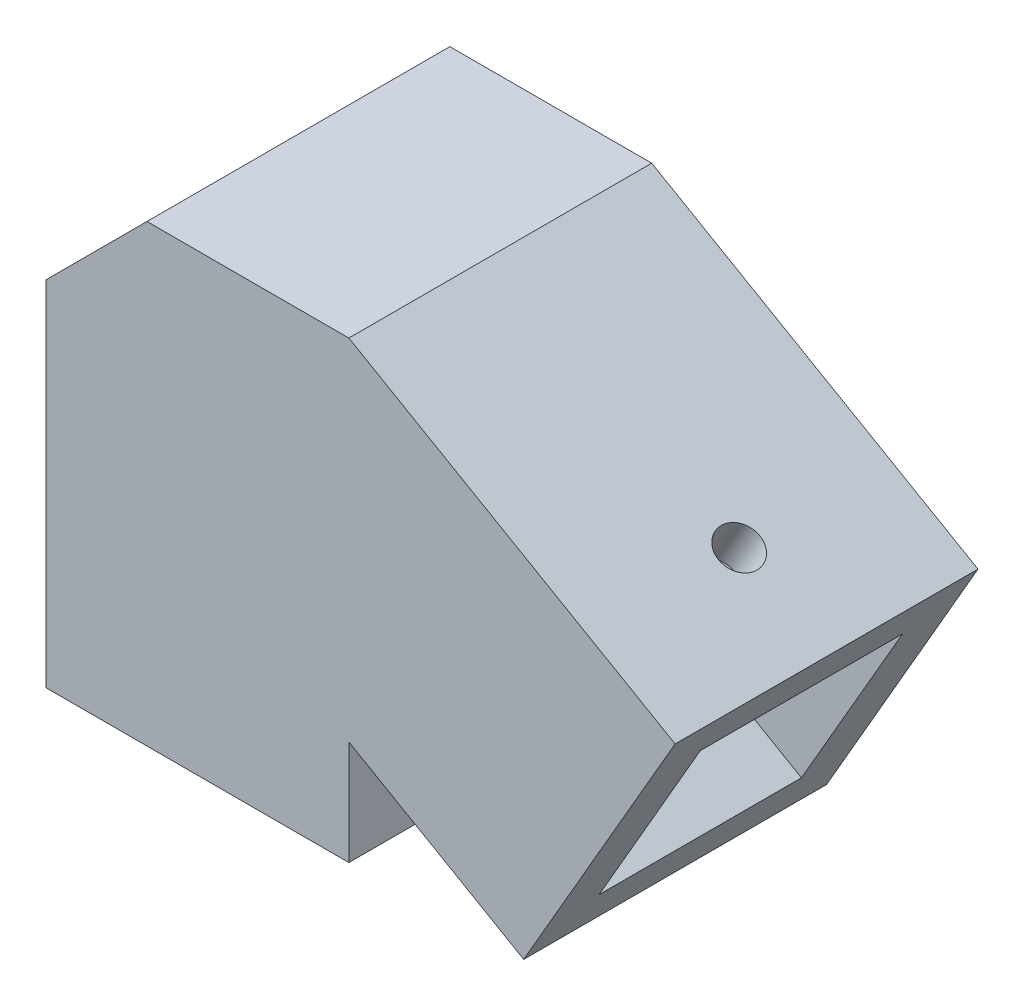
ISO-10303-21;
HEADER;
FILE_DESCRIPTION(('STEP AP214'),'2;1');
FILE_NAME('part.step','',(''),(''),'','','');
FILE_SCHEMA(('AUTOMOTIVE_DESIGN { 1 0 10303 214 1 1 1 1 }'));
ENDSEC;
DATA;
#1=APPLICATION_CONTEXT('core data for automotive mechanical design processes');
#2=APPLICATION_PROTOCOL_DEFINITION('international standard','automotive_design',2000,#1);
#3=PRODUCT_CONTEXT('',#1,'mechanical');
#4=PRODUCT('Part','Part','',(#3));
#5=PRODUCT_RELATED_PRODUCT_CATEGORY('part','',(#4));
#6=PRODUCT_DEFINITION_FORMATION('','',#4);
#7=PRODUCT_DEFINITION_CONTEXT('part definition',#1,'design');
#8=PRODUCT_DEFINITION('design','',#6,#7);
#9=PRODUCT_DEFINITION_SHAPE('','',#8);
#10=(LENGTH_UNIT() NAMED_UNIT(*) SI_UNIT(.MILLI.,.METRE.));
#11=(NAMED_UNIT(*) PLANE_ANGLE_UNIT() SI_UNIT($,.RADIAN.));
#12=(NAMED_UNIT(*) SI_UNIT($,.STERADIAN.) SOLID_ANGLE_UNIT());
#13=UNCERTAINTY_MEASURE_WITH_UNIT(LENGTH_MEASURE(1.E-05),#10,'distance_accuracy_value','');
#14=(GEOMETRIC_REPRESENTATION_CONTEXT(3) GLOBAL_UNCERTAINTY_ASSIGNED_CONTEXT((#13)) GLOBAL_UNIT_ASSIGNED_CONTEXT((#10,
#11,#12)) REPRESENTATION_CONTEXT('',''));
#15=CARTESIAN_POINT('',(0.,0.,0.));
#16=DIRECTION('',(0.,0.,1.));
#17=DIRECTION('',(1.,0.,0.));
#18=AXIS2_PLACEMENT_3D('',#15,#16,#17);
#19=CARTESIAN_POINT('',(15.,-25.,15.));
#20=DIRECTION('',(1.,0.,0.));
#21=DIRECTION('',(0.,0.,-1.));
#22=AXIS2_PLACEMENT_3D('',#19,#20,#21);
#23=PLANE('',#22);
#24=DIRECTION('',(0.,1.,0.));
#25=VECTOR('',#24,1.);
#26=CARTESIAN_POINT('',(15.,-25.,-15.));
#27=LINE('',#26,#25);
#28=CARTESIAN_POINT('',(15.,-25.,-15.));
#29=VERTEX_POINT('',#28);
#30=CARTESIAN_POINT('',(15.,-14.6410161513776,-15.));
#31=VERTEX_POINT('',#30);
#32=EDGE_CURVE('E324',#29,#31,#27,.T.);
#33=ORIENTED_EDGE('',*,*,#32,.T.);
#34=DIRECTION('',(0.,0.,1.));
#35=VECTOR('',#34,1.);
#36=CARTESIAN_POINT('',(15.,-14.6410161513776,-70.1129346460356));
#37=LINE('',#36,#35);
#38=CARTESIAN_POINT('',(15.,-14.6410161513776,15.));
#39=VERTEX_POINT('',#38);
#40=EDGE_CURVE('E282',#31,#39,#37,.T.);
#41=ORIENTED_EDGE('',*,*,#40,.T.);
#42=DIRECTION('',(0.,1.,0.));
#43=VECTOR('',#42,1.);
#44=CARTESIAN_POINT('',(15.,-25.,15.));
#45=LINE('',#44,#43);
#46=CARTESIAN_POINT('',(15.,-25.,15.));
#47=VERTEX_POINT('',#46);
#48=EDGE_CURVE('E321',#47,#39,#45,.T.);
#49=ORIENTED_EDGE('',*,*,#48,.F.);
#50=DIRECTION('',(0.,0.,-1.));
#51=VECTOR('',#50,1.);
#52=CARTESIAN_POINT('',(15.,-25.,15.));
#53=LINE('',#52,#51);
#54=EDGE_CURVE('E304',#47,#29,#53,.T.);
#55=ORIENTED_EDGE('',*,*,#54,.T.);
#56=EDGE_LOOP('',(#33,#41,#49,#55));
#57=FACE_BOUND('',#56,.T.);
#58=ADVANCED_FACE('F50',(#57),#23,.T.);
#59=CARTESIAN_POINT('',(-15.,-25.,15.));
#60=DIRECTION('',(0.,0.,1.));
#61=DIRECTION('',(1.,0.,0.));
#62=AXIS2_PLACEMENT_3D('',#59,#60,#61);
#63=PLANE('',#62);
#64=DIRECTION('',(1.,0.,0.));
#65=VECTOR('',#64,1.);
#66=CARTESIAN_POINT('',(-15.,20.,15.));
#67=LINE('',#66,#65);
#68=CARTESIAN_POINT('',(-5.00000000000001,20.,15.));
#69=VERTEX_POINT('',#68);
#70=CARTESIAN_POINT('',(15.,20.,15.));
#71=VERTEX_POINT('',#70);
#72=EDGE_CURVE('E305',#69,#71,#67,.T.);
#73=ORIENTED_EDGE('',*,*,#72,.F.);
#74=DIRECTION('',(-0.707106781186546,-0.707106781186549,0.));
#75=VECTOR('',#74,1.);
#76=CARTESIAN_POINT('',(-32.5,-7.50000000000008,15.));
#77=LINE('',#76,#75);
#78=CARTESIAN_POINT('',(-15.,9.99999999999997,15.));
#79=VERTEX_POINT('',#78);
#80=EDGE_CURVE('E71',#69,#79,#77,.T.);
#81=ORIENTED_EDGE('',*,*,#80,.T.);
#82=DIRECTION('',(0.,1.,0.));
#83=VECTOR('',#82,1.);
#84=CARTESIAN_POINT('',(-15.,-25.,15.));
#85=LINE('',#84,#83);
#86=CARTESIAN_POINT('',(-15.,-25.,15.));
#87=VERTEX_POINT('',#86);
#88=EDGE_CURVE('E330',#87,#79,#85,.T.);
#89=ORIENTED_EDGE('',*,*,#88,.F.);
#90=DIRECTION('',(1.,0.,0.));
#91=VECTOR('',#90,1.);
#92=CARTESIAN_POINT('',(-15.,-25.,15.));
#93=LINE('',#92,#91);
#94=EDGE_CURVE('E320',#87,#47,#93,.T.);
#95=ORIENTED_EDGE('',*,*,#94,.T.);
#96=ORIENTED_EDGE('',*,*,#48,.T.);
#97=DIRECTION('',(0.866025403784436,-0.500000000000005,0.));
#98=VECTOR('',#97,1.);
#99=CARTESIAN_POINT('',(15.,-14.6410161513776,15.));
#100=LINE('',#99,#98);
#101=CARTESIAN_POINT('',(32.3205080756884,-24.6410161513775,15.));
#102=VERTEX_POINT('',#101);
#103=EDGE_CURVE('E255',#39,#102,#100,.T.);
#104=ORIENTED_EDGE('',*,*,#103,.T.);
#105=DIRECTION('',(0.500000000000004,0.866025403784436,0.));
#106=VECTOR('',#105,1.);
#107=CARTESIAN_POINT('',(32.3205080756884,-24.6410161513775,15.));
#108=LINE('',#107,#106);
#109=CARTESIAN_POINT('',(47.3205080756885,1.33974596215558,15.));
#110=VERTEX_POINT('',#109);
#111=EDGE_CURVE('E267',#102,#110,#108,.T.);
#112=ORIENTED_EDGE('',*,*,#111,.T.);
#113=DIRECTION('',(-0.866025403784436,0.500000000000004,0.));
#114=VECTOR('',#113,1.);
#115=CARTESIAN_POINT('',(15.,20.,15.));
#116=LINE('',#115,#114);
#117=EDGE_CURVE('E265',#110,#71,#116,.T.);
#118=ORIENTED_EDGE('',*,*,#117,.T.);
#119=EDGE_LOOP('',(#73,#81,#89,#95,#96,#104,#112,#118));
#120=FACE_BOUND('',#119,.T.);
#121=ADVANCED_FACE('F348',(#120),#63,.T.);
#122=CARTESIAN_POINT('',(-15.,-25.,15.));
#123=DIRECTION('',(-1.,0.,0.));
#124=DIRECTION('',(0.,0.,1.));
#125=AXIS2_PLACEMENT_3D('',#122,#123,#124);
#126=PLANE('',#125);
#127=CARTESIAN_POINT('',(-15.,-15.,0.));
#128=DIRECTION('',(-1.,0.,0.));
#129=DIRECTION('',(0.,0.,1.));
#130=AXIS2_PLACEMENT_3D('',#127,#128,#129);
#131=CIRCLE('',#130,2.05);
#132=CARTESIAN_POINT('',(-15.,-15.,2.05));
#133=VERTEX_POINT('',#132);
#134=EDGE_CURVE('E437',#133,#133,#131,.T.);
#135=ORIENTED_EDGE('',*,*,#134,.F.);
#136=EDGE_LOOP('',(#135));
#137=FACE_BOUND('',#136,.T.);
#138=ORIENTED_EDGE('',*,*,#88,.T.);
#139=DIRECTION('',(0.,0.,-1.));
#140=VECTOR('',#139,1.);
#141=CARTESIAN_POINT('',(-15.,9.99999999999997,-15.));
#142=LINE('',#141,#140);
#143=CARTESIAN_POINT('',(-15.,9.99999999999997,-15.));
#144=VERTEX_POINT('',#143);
#145=EDGE_CURVE('E60',#79,#144,#142,.T.);
#146=ORIENTED_EDGE('',*,*,#145,.T.);
#147=DIRECTION('',(0.,1.,0.));
#148=VECTOR('',#147,1.);
#149=CARTESIAN_POINT('',(-15.,-25.,-15.));
#150=LINE('',#149,#148);
#151=CARTESIAN_POINT('',(-15.,-25.,-15.));
#152=VERTEX_POINT('',#151);
#153=EDGE_CURVE('E326',#152,#144,#150,.T.);
#154=ORIENTED_EDGE('',*,*,#153,.F.);
#155=DIRECTION('',(0.,0.,1.));
#156=VECTOR('',#155,1.);
#157=CARTESIAN_POINT('',(-15.,-25.,15.));
#158=LINE('',#157,#156);
#159=EDGE_CURVE('E312',#152,#87,#158,.T.);
#160=ORIENTED_EDGE('',*,*,#159,.T.);
#161=EDGE_LOOP('',(#138,#146,#154,#160));
#162=FACE_BOUND('',#161,.T.);
#163=ADVANCED_FACE('F372',(#137,#162),#126,.T.);
#164=CARTESIAN_POINT('',(-15.,-25.,-15.));
#165=DIRECTION('',(0.,0.,-1.));
#166=DIRECTION('',(-1.,0.,0.));
#167=AXIS2_PLACEMENT_3D('',#164,#165,#166);
#168=PLANE('',#167);
#169=ORIENTED_EDGE('',*,*,#153,.T.);
#170=DIRECTION('',(0.707106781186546,0.707106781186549,0.));
#171=VECTOR('',#170,1.);
#172=CARTESIAN_POINT('',(-32.5,-7.50000000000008,-15.));
#173=LINE('',#172,#171);
#174=CARTESIAN_POINT('',(-5.00000000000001,20.,-15.));
#175=VERTEX_POINT('',#174);
#176=EDGE_CURVE('E11',#144,#175,#173,.T.);
#177=ORIENTED_EDGE('',*,*,#176,.T.);
#178=DIRECTION('',(-1.,0.,0.));
#179=VECTOR('',#178,1.);
#180=CARTESIAN_POINT('',(-15.,20.,-15.));
#181=LINE('',#180,#179);
#182=CARTESIAN_POINT('',(15.,20.,-15.));
#183=VERTEX_POINT('',#182);
#184=EDGE_CURVE('E296',#183,#175,#181,.T.);
#185=ORIENTED_EDGE('',*,*,#184,.F.);
#186=DIRECTION('',(-0.866025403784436,0.500000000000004,0.));
#187=VECTOR('',#186,1.);
#188=CARTESIAN_POINT('',(15.,20.,-15.));
#189=LINE('',#188,#187);
#190=CARTESIAN_POINT('',(47.3205080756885,1.33974596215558,-15.));
#191=VERTEX_POINT('',#190);
#192=EDGE_CURVE('E280',#191,#183,#189,.T.);
#193=ORIENTED_EDGE('',*,*,#192,.F.);
#194=DIRECTION('',(0.500000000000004,0.866025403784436,0.));
#195=VECTOR('',#194,1.);
#196=CARTESIAN_POINT('',(32.3205080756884,-24.6410161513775,-15.));
#197=LINE('',#196,#195);
#198=CARTESIAN_POINT('',(32.3205080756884,-24.6410161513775,-15.));
#199=VERTEX_POINT('',#198);
#200=EDGE_CURVE('E283',#199,#191,#197,.T.);
#201=ORIENTED_EDGE('',*,*,#200,.F.);
#202=DIRECTION('',(0.866025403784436,-0.500000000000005,0.));
#203=VECTOR('',#202,1.);
#204=CARTESIAN_POINT('',(15.,-14.6410161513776,-15.));
#205=LINE('',#204,#203);
#206=EDGE_CURVE('E266',#31,#199,#205,.T.);
#207=ORIENTED_EDGE('',*,*,#206,.F.);
#208=ORIENTED_EDGE('',*,*,#32,.F.);
#209=DIRECTION('',(-1.,0.,0.));
#210=VECTOR('',#209,1.);
#211=CARTESIAN_POINT('',(-15.,-25.,-15.));
#212=LINE('',#211,#210);
#213=EDGE_CURVE('E307',#29,#152,#212,.T.);
#214=ORIENTED_EDGE('',*,*,#213,.T.);
#215=EDGE_LOOP('',(#169,#177,#185,#193,#201,#207,#208,#214));
#216=FACE_BOUND('',#215,.T.);
#217=ADVANCED_FACE('F355',(#216),#168,.T.);
#218=CARTESIAN_POINT('',(0.,-25.,0.));
#219=DIRECTION('',(0.,-1.,0.));
#220=DIRECTION('',(0.,0.,-1.));
#221=AXIS2_PLACEMENT_3D('',#218,#219,#220);
#222=PLANE('',#221);
#223=DIRECTION('',(0.,0.,1.));
#224=VECTOR('',#223,1.);
#225=CARTESIAN_POINT('',(10.025,-25.,-10.025));
#226=LINE('',#225,#224);
#227=CARTESIAN_POINT('',(10.025,-25.,-10.025));
#228=VERTEX_POINT('',#227);
#229=CARTESIAN_POINT('',(10.025,-25.,10.025));
#230=VERTEX_POINT('',#229);
#231=EDGE_CURVE('E211',#228,#230,#226,.T.);
#232=ORIENTED_EDGE('',*,*,#231,.F.);
#233=DIRECTION('',(1.,0.,0.));
#234=VECTOR('',#233,1.);
#235=CARTESIAN_POINT('',(-10.025,-25.,-10.025));
#236=LINE('',#235,#234);
#237=CARTESIAN_POINT('',(-10.025,-25.,-10.025));
#238=VERTEX_POINT('',#237);
#239=EDGE_CURVE('E224',#238,#228,#236,.T.);
#240=ORIENTED_EDGE('',*,*,#239,.F.);
#241=DIRECTION('',(0.,0.,-1.));
#242=VECTOR('',#241,1.);
#243=CARTESIAN_POINT('',(-10.025,-25.,-10.025));
#244=LINE('',#243,#242);
#245=CARTESIAN_POINT('',(-10.025,-25.,10.025));
#246=VERTEX_POINT('',#245);
#247=EDGE_CURVE('E245',#246,#238,#244,.T.);
#248=ORIENTED_EDGE('',*,*,#247,.F.);
#249=DIRECTION('',(-1.,0.,0.));
#250=VECTOR('',#249,1.);
#251=CARTESIAN_POINT('',(-10.025,-25.,10.025));
#252=LINE('',#251,#250);
#253=EDGE_CURVE('E238',#230,#246,#252,.T.);
#254=ORIENTED_EDGE('',*,*,#253,.F.);
#255=EDGE_LOOP('',(#232,#240,#248,#254));
#256=FACE_BOUND('',#255,.T.);
#257=ORIENTED_EDGE('',*,*,#54,.F.);
#258=ORIENTED_EDGE('',*,*,#94,.F.);
#259=ORIENTED_EDGE('',*,*,#159,.F.);
#260=ORIENTED_EDGE('',*,*,#213,.F.);
#261=EDGE_LOOP('',(#257,#258,#259,#260));
#262=FACE_BOUND('',#261,.T.);
#263=ADVANCED_FACE('F378',(#256,#262),#222,.T.);
#264=CARTESIAN_POINT('',(0.,20.,0.));
#265=DIRECTION('',(0.,-1.,0.));
#266=DIRECTION('',(0.,0.,-1.));
#267=AXIS2_PLACEMENT_3D('',#264,#265,#266);
#268=PLANE('',#267);
#269=ORIENTED_EDGE('',*,*,#184,.T.);
#270=DIRECTION('',(0.,0.,1.));
#271=VECTOR('',#270,1.);
#272=CARTESIAN_POINT('',(-5.00000000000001,20.,15.));
#273=LINE('',#272,#271);
#274=EDGE_CURVE('E327',#175,#69,#273,.T.);
#275=ORIENTED_EDGE('',*,*,#274,.T.);
#276=ORIENTED_EDGE('',*,*,#72,.T.);
#277=DIRECTION('',(0.,0.,-1.));
#278=VECTOR('',#277,1.);
#279=CARTESIAN_POINT('',(15.,20.,15.));
#280=LINE('',#279,#278);
#281=EDGE_CURVE('E295',#71,#183,#280,.T.);
#282=ORIENTED_EDGE('',*,*,#281,.T.);
#283=EDGE_LOOP('',(#269,#275,#276,#282));
#284=FACE_BOUND('',#283,.T.);
#285=ADVANCED_FACE('F345',(#284),#268,.F.);
#286=CARTESIAN_POINT('',(15.,-14.6410161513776,-70.1129346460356));
#287=DIRECTION('',(-0.500000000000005,-0.866025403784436,0.));
#288=DIRECTION('',(0.866025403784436,-0.500000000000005,0.));
#289=AXIS2_PLACEMENT_3D('',#286,#287,#288);
#290=PLANE('',#289);
#291=ORIENTED_EDGE('',*,*,#40,.F.);
#292=ORIENTED_EDGE('',*,*,#206,.T.);
#293=DIRECTION('',(0.,0.,1.));
#294=VECTOR('',#293,1.);
#295=CARTESIAN_POINT('',(32.3205080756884,-24.6410161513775,-70.1129346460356));
#296=LINE('',#295,#294);
#297=EDGE_CURVE('E276',#199,#102,#296,.T.);
#298=ORIENTED_EDGE('',*,*,#297,.T.);
#299=ORIENTED_EDGE('',*,*,#103,.F.);
#300=EDGE_LOOP('',(#291,#292,#298,#299));
#301=FACE_BOUND('',#300,.T.);
#302=ADVANCED_FACE('F386',(#301),#290,.T.);
#303=CARTESIAN_POINT('',(32.3205080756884,-24.6410161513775,-70.1129346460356));
#304=DIRECTION('',(0.866025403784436,-0.500000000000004,0.));
#305=DIRECTION('',(0.500000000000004,0.866025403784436,0.));
#306=AXIS2_PLACEMENT_3D('',#303,#304,#305);
#307=PLANE('',#306);
#308=DIRECTION('',(0.500000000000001,0.866025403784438,0.));
#309=VECTOR('',#308,1.);
#310=CARTESIAN_POINT('',(34.8080080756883,-20.3325397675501,-10.025));
#311=LINE('',#310,#309);
#312=CARTESIAN_POINT('',(34.8080080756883,-20.3325397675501,-10.025));
#313=VERTEX_POINT('',#312);
#314=CARTESIAN_POINT('',(44.8330080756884,-2.96873042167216,-10.025));
#315=VERTEX_POINT('',#314);
#316=EDGE_CURVE('E170',#313,#315,#311,.T.);
#317=ORIENTED_EDGE('',*,*,#316,.F.);
#318=DIRECTION('',(0.,0.,-1.));
#319=VECTOR('',#318,1.);
#320=CARTESIAN_POINT('',(34.8080080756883,-20.3325397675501,10.025));
#321=LINE('',#320,#319);
#322=CARTESIAN_POINT('',(34.8080080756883,-20.3325397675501,10.025));
#323=VERTEX_POINT('',#322);
#324=EDGE_CURVE('E190',#323,#313,#321,.T.);
#325=ORIENTED_EDGE('',*,*,#324,.F.);
#326=DIRECTION('',(-0.500000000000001,-0.866025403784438,0.));
#327=VECTOR('',#326,1.);
#328=CARTESIAN_POINT('',(34.8080080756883,-20.3325397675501,10.025));
#329=LINE('',#328,#327);
#330=CARTESIAN_POINT('',(44.8330080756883,-2.96873042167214,10.025));
#331=VERTEX_POINT('',#330);
#332=EDGE_CURVE('E194',#331,#323,#329,.T.);
#333=ORIENTED_EDGE('',*,*,#332,.F.);
#334=DIRECTION('',(0.,0.,1.));
#335=VECTOR('',#334,1.);
#336=CARTESIAN_POINT('',(44.8330080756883,-2.96873042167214,10.025));
#337=LINE('',#336,#335);
#338=EDGE_CURVE('E204',#315,#331,#337,.T.);
#339=ORIENTED_EDGE('',*,*,#338,.F.);
#340=EDGE_LOOP('',(#317,#325,#333,#339));
#341=FACE_BOUND('',#340,.T.);
#342=ORIENTED_EDGE('',*,*,#297,.F.);
#343=ORIENTED_EDGE('',*,*,#200,.T.);
#344=DIRECTION('',(0.,0.,1.));
#345=VECTOR('',#344,1.);
#346=CARTESIAN_POINT('',(47.3205080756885,1.33974596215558,-70.1129346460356));
#347=LINE('',#346,#345);
#348=EDGE_CURVE('E285',#191,#110,#347,.T.);
#349=ORIENTED_EDGE('',*,*,#348,.T.);
#350=ORIENTED_EDGE('',*,*,#111,.F.);
#351=EDGE_LOOP('',(#342,#343,#349,#350));
#352=FACE_BOUND('',#351,.T.);
#353=ADVANCED_FACE('F388',(#341,#352),#307,.T.);
#354=CARTESIAN_POINT('',(15.,20.,-70.1129346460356));
#355=DIRECTION('',(0.500000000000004,0.866025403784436,0.));
#356=DIRECTION('',(-0.866025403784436,0.500000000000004,0.));
#357=AXIS2_PLACEMENT_3D('',#354,#355,#356);
#358=PLANE('',#357);
#359=CARTESIAN_POINT('',(38.6602540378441,6.33974596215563,0.));
#360=DIRECTION('',(0.500000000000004,0.866025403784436,0.));
#361=DIRECTION('',(-0.866025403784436,0.500000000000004,0.));
#362=AXIS2_PLACEMENT_3D('',#359,#360,#361);
#363=CIRCLE('',#362,2.05);
#364=CARTESIAN_POINT('',(36.884901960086,7.36474596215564,0.));
#365=VERTEX_POINT('',#364);
#366=EDGE_CURVE('E442',#365,#365,#363,.T.);
#367=ORIENTED_EDGE('',*,*,#366,.F.);
#368=EDGE_LOOP('',(#367));
#369=FACE_BOUND('',#368,.T.);
#370=ORIENTED_EDGE('',*,*,#348,.F.);
#371=ORIENTED_EDGE('',*,*,#192,.T.);
#372=ORIENTED_EDGE('',*,*,#281,.F.);
#373=ORIENTED_EDGE('',*,*,#117,.F.);
#374=EDGE_LOOP('',(#370,#371,#372,#373));
#375=FACE_BOUND('',#374,.T.);
#376=ADVANCED_FACE('F354',(#369,#375),#358,.T.);
#377=CARTESIAN_POINT('',(10.025,-5.,-10.025));
#378=DIRECTION('',(1.,0.,0.));
#379=DIRECTION('',(0.,0.,-1.));
#380=AXIS2_PLACEMENT_3D('',#377,#378,#379);
#381=PLANE('',#380);
#382=ORIENTED_EDGE('',*,*,#231,.T.);
#383=DIRECTION('',(0.,-1.,0.));
#384=VECTOR('',#383,1.);
#385=CARTESIAN_POINT('',(10.025,-5.,10.025));
#386=LINE('',#385,#384);
#387=CARTESIAN_POINT('',(10.025,-5.,10.025));
#388=VERTEX_POINT('',#387);
#389=EDGE_CURVE('E232',#388,#230,#386,.T.);
#390=ORIENTED_EDGE('',*,*,#389,.F.);
#391=DIRECTION('',(0.,0.,1.));
#392=VECTOR('',#391,1.);
#393=CARTESIAN_POINT('',(10.025,-5.,-10.025));
#394=LINE('',#393,#392);
#395=CARTESIAN_POINT('',(10.025,-5.,-10.025));
#396=VERTEX_POINT('',#395);
#397=EDGE_CURVE('E218',#396,#388,#394,.T.);
#398=ORIENTED_EDGE('',*,*,#397,.F.);
#399=DIRECTION('',(0.,-1.,0.));
#400=VECTOR('',#399,1.);
#401=CARTESIAN_POINT('',(10.025,-5.,-10.025));
#402=LINE('',#401,#400);
#403=EDGE_CURVE('E248',#396,#228,#402,.T.);
#404=ORIENTED_EDGE('',*,*,#403,.T.);
#405=EDGE_LOOP('',(#382,#390,#398,#404));
#406=FACE_BOUND('',#405,.T.);
#407=ADVANCED_FACE('F391',(#406),#381,.F.);
#408=CARTESIAN_POINT('',(-10.025,-5.,-10.025));
#409=DIRECTION('',(0.,0.,-1.));
#410=DIRECTION('',(-1.,0.,0.));
#411=AXIS2_PLACEMENT_3D('',#408,#409,#410);
#412=PLANE('',#411);
#413=ORIENTED_EDGE('',*,*,#239,.T.);
#414=ORIENTED_EDGE('',*,*,#403,.F.);
#415=DIRECTION('',(1.,0.,0.));
#416=VECTOR('',#415,1.);
#417=CARTESIAN_POINT('',(-10.025,-5.,-10.025));
#418=LINE('',#417,#416);
#419=CARTESIAN_POINT('',(-10.025,-5.,-10.025));
#420=VERTEX_POINT('',#419);
#421=EDGE_CURVE('E233',#420,#396,#418,.T.);
#422=ORIENTED_EDGE('',*,*,#421,.F.);
#423=DIRECTION('',(0.,-1.,0.));
#424=VECTOR('',#423,1.);
#425=CARTESIAN_POINT('',(-10.025,-5.,-10.025));
#426=LINE('',#425,#424);
#427=EDGE_CURVE('E254',#420,#238,#426,.T.);
#428=ORIENTED_EDGE('',*,*,#427,.T.);
#429=EDGE_LOOP('',(#413,#414,#422,#428));
#430=FACE_BOUND('',#429,.T.);
#431=ADVANCED_FACE('F398',(#430),#412,.F.);
#432=CARTESIAN_POINT('',(-10.025,-5.,-10.025));
#433=DIRECTION('',(-1.,0.,0.));
#434=DIRECTION('',(0.,0.,1.));
#435=AXIS2_PLACEMENT_3D('',#432,#433,#434);
#436=PLANE('',#435);
#437=CARTESIAN_POINT('',(-10.025,-15.,0.));
#438=DIRECTION('',(-1.,0.,0.));
#439=DIRECTION('',(0.,0.,1.));
#440=AXIS2_PLACEMENT_3D('',#437,#438,#439);
#441=CIRCLE('',#440,2.05);
#442=CARTESIAN_POINT('',(-10.025,-15.,2.05));
#443=VERTEX_POINT('',#442);
#444=EDGE_CURVE('E436',#443,#443,#441,.F.);
#445=ORIENTED_EDGE('',*,*,#444,.F.);
#446=EDGE_LOOP('',(#445));
#447=FACE_BOUND('',#446,.T.);
#448=ORIENTED_EDGE('',*,*,#247,.T.);
#449=ORIENTED_EDGE('',*,*,#427,.F.);
#450=DIRECTION('',(0.,0.,-1.));
#451=VECTOR('',#450,1.);
#452=CARTESIAN_POINT('',(-10.025,-5.,-10.025));
#453=LINE('',#452,#451);
#454=CARTESIAN_POINT('',(-10.025,-5.,10.025));
#455=VERTEX_POINT('',#454);
#456=EDGE_CURVE('E227',#455,#420,#453,.T.);
#457=ORIENTED_EDGE('',*,*,#456,.F.);
#458=DIRECTION('',(0.,-1.,0.));
#459=VECTOR('',#458,1.);
#460=CARTESIAN_POINT('',(-10.025,-5.,10.025));
#461=LINE('',#460,#459);
#462=EDGE_CURVE('E259',#455,#246,#461,.T.);
#463=ORIENTED_EDGE('',*,*,#462,.T.);
#464=EDGE_LOOP('',(#448,#449,#457,#463));
#465=FACE_BOUND('',#464,.T.);
#466=ADVANCED_FACE('F403',(#447,#465),#436,.F.);
#467=CARTESIAN_POINT('',(-10.025,-5.,10.025));
#468=DIRECTION('',(0.,0.,1.));
#469=DIRECTION('',(1.,0.,0.));
#470=AXIS2_PLACEMENT_3D('',#467,#468,#469);
#471=PLANE('',#470);
#472=ORIENTED_EDGE('',*,*,#253,.T.);
#473=ORIENTED_EDGE('',*,*,#462,.F.);
#474=DIRECTION('',(-1.,0.,0.));
#475=VECTOR('',#474,1.);
#476=CARTESIAN_POINT('',(-10.025,-5.,10.025));
#477=LINE('',#476,#475);
#478=EDGE_CURVE('E222',#388,#455,#477,.T.);
#479=ORIENTED_EDGE('',*,*,#478,.F.);
#480=ORIENTED_EDGE('',*,*,#389,.T.);
#481=EDGE_LOOP('',(#472,#473,#479,#480));
#482=FACE_BOUND('',#481,.T.);
#483=ADVANCED_FACE('F402',(#482),#471,.F.);
#484=CARTESIAN_POINT('',(0.,-5.,0.));
#485=DIRECTION('',(0.,1.,0.));
#486=DIRECTION('',(0.,0.,1.));
#487=AXIS2_PLACEMENT_3D('',#484,#485,#486);
#488=PLANE('',#487);
#489=ORIENTED_EDGE('',*,*,#397,.T.);
#490=ORIENTED_EDGE('',*,*,#478,.T.);
#491=ORIENTED_EDGE('',*,*,#456,.T.);
#492=ORIENTED_EDGE('',*,*,#421,.T.);
#493=EDGE_LOOP('',(#489,#490,#491,#492));
#494=FACE_BOUND('',#493,.T.);
#495=ADVANCED_FACE('F404',(#494),#488,.F.);
#496=CARTESIAN_POINT('',(14.8894237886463,-8.83253976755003,-10.025));
#497=DIRECTION('',(0.,0.,-1.));
#498=DIRECTION('',(-1.,0.,0.));
#499=AXIS2_PLACEMENT_3D('',#496,#497,#498);
#500=PLANE('',#499);
#501=ORIENTED_EDGE('',*,*,#316,.T.);
#502=DIRECTION('',(0.866025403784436,-0.500000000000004,0.));
#503=VECTOR('',#502,1.);
#504=CARTESIAN_POINT('',(24.9144237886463,8.53126957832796,-10.025));
#505=LINE('',#504,#503);
#506=CARTESIAN_POINT('',(24.9144237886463,8.53126957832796,-10.025));
#507=VERTEX_POINT('',#506);
#508=EDGE_CURVE('E160',#507,#315,#505,.T.);
#509=ORIENTED_EDGE('',*,*,#508,.F.);
#510=DIRECTION('',(0.500000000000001,0.866025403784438,0.));
#511=VECTOR('',#510,1.);
#512=CARTESIAN_POINT('',(14.8894237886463,-8.83253976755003,-10.025));
#513=LINE('',#512,#511);
#514=CARTESIAN_POINT('',(14.8894237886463,-8.83253976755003,-10.025));
#515=VERTEX_POINT('',#514);
#516=EDGE_CURVE('E165',#515,#507,#513,.T.);
#517=ORIENTED_EDGE('',*,*,#516,.F.);
#518=DIRECTION('',(0.866025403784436,-0.500000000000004,0.));
#519=VECTOR('',#518,1.);
#520=CARTESIAN_POINT('',(14.8894237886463,-8.83253976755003,-10.025));
#521=LINE('',#520,#519);
#522=EDGE_CURVE('E209',#515,#313,#521,.T.);
#523=ORIENTED_EDGE('',*,*,#522,.T.);
#524=EDGE_LOOP('',(#501,#509,#517,#523));
#525=FACE_BOUND('',#524,.T.);
#526=ADVANCED_FACE('F162',(#525),#500,.F.);
#527=CARTESIAN_POINT('',(14.8894237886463,-8.83253976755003,10.025));
#528=DIRECTION('',(-0.500000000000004,-0.866025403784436,0.));
#529=DIRECTION('',(0.866025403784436,-0.500000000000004,0.));
#530=AXIS2_PLACEMENT_3D('',#527,#528,#529);
#531=PLANE('',#530);
#532=ORIENTED_EDGE('',*,*,#324,.T.);
#533=ORIENTED_EDGE('',*,*,#522,.F.);
#534=DIRECTION('',(0.,0.,-1.));
#535=VECTOR('',#534,1.);
#536=CARTESIAN_POINT('',(14.8894237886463,-8.83253976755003,10.025));
#537=LINE('',#536,#535);
#538=CARTESIAN_POINT('',(14.8894237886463,-8.83253976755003,10.025));
#539=VERTEX_POINT('',#538);
#540=EDGE_CURVE('E173',#539,#515,#537,.T.);
#541=ORIENTED_EDGE('',*,*,#540,.F.);
#542=DIRECTION('',(0.866025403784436,-0.500000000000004,0.));
#543=VECTOR('',#542,1.);
#544=CARTESIAN_POINT('',(14.8894237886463,-8.83253976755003,10.025));
#545=LINE('',#544,#543);
#546=EDGE_CURVE('E215',#539,#323,#545,.T.);
#547=ORIENTED_EDGE('',*,*,#546,.T.);
#548=EDGE_LOOP('',(#532,#533,#541,#547));
#549=FACE_BOUND('',#548,.T.);
#550=ADVANCED_FACE('F419',(#549),#531,.F.);
#551=CARTESIAN_POINT('',(14.8894237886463,-8.83253976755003,10.025));
#552=DIRECTION('',(0.,0.,1.));
#553=DIRECTION('',(1.,0.,0.));
#554=AXIS2_PLACEMENT_3D('',#551,#552,#553);
#555=PLANE('',#554);
#556=ORIENTED_EDGE('',*,*,#332,.T.);
#557=ORIENTED_EDGE('',*,*,#546,.F.);
#558=DIRECTION('',(-0.500000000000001,-0.866025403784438,0.));
#559=VECTOR('',#558,1.);
#560=CARTESIAN_POINT('',(14.8894237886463,-8.83253976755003,10.025));
#561=LINE('',#560,#559);
#562=CARTESIAN_POINT('',(24.9144237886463,8.53126957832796,10.025));
#563=VERTEX_POINT('',#562);
#564=EDGE_CURVE('E185',#563,#539,#561,.T.);
#565=ORIENTED_EDGE('',*,*,#564,.F.);
#566=DIRECTION('',(0.866025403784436,-0.500000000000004,0.));
#567=VECTOR('',#566,1.);
#568=CARTESIAN_POINT('',(24.9144237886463,8.53126957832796,10.025));
#569=LINE('',#568,#567);
#570=EDGE_CURVE('E175',#563,#331,#569,.T.);
#571=ORIENTED_EDGE('',*,*,#570,.T.);
#572=EDGE_LOOP('',(#556,#557,#565,#571));
#573=FACE_BOUND('',#572,.T.);
#574=ADVANCED_FACE('F423',(#573),#555,.F.);
#575=CARTESIAN_POINT('',(24.9144237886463,8.53126957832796,10.025));
#576=DIRECTION('',(0.500000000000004,0.866025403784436,0.));
#577=DIRECTION('',(-0.866025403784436,0.500000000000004,0.));
#578=AXIS2_PLACEMENT_3D('',#575,#576,#577);
#579=PLANE('',#578);
#580=CARTESIAN_POINT('',(36.172754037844,2.03126957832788,0.));
#581=DIRECTION('',(0.500000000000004,0.866025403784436,0.));
#582=DIRECTION('',(-0.866025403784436,0.500000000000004,0.));
#583=AXIS2_PLACEMENT_3D('',#580,#581,#582);
#584=CIRCLE('',#583,2.05);
#585=CARTESIAN_POINT('',(34.3974019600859,3.05626957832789,0.));
#586=VERTEX_POINT('',#585);
#587=EDGE_CURVE('E193',#586,#586,#584,.F.);
#588=ORIENTED_EDGE('',*,*,#587,.F.);
#589=EDGE_LOOP('',(#588));
#590=FACE_BOUND('',#589,.T.);
#591=ORIENTED_EDGE('',*,*,#338,.T.);
#592=ORIENTED_EDGE('',*,*,#570,.F.);
#593=DIRECTION('',(0.,0.,1.));
#594=VECTOR('',#593,1.);
#595=CARTESIAN_POINT('',(24.9144237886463,8.53126957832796,10.025));
#596=LINE('',#595,#594);
#597=EDGE_CURVE('E176',#507,#563,#596,.T.);
#598=ORIENTED_EDGE('',*,*,#597,.F.);
#599=ORIENTED_EDGE('',*,*,#508,.T.);
#600=EDGE_LOOP('',(#591,#592,#598,#599));
#601=FACE_BOUND('',#600,.T.);
#602=ADVANCED_FACE('F180',(#590,#601),#579,.F.);
#603=CARTESIAN_POINT('',(14.9916697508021,-8.65544456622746,0.));
#604=DIRECTION('',(-0.866025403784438,0.500000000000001,0.));
#605=DIRECTION('',(-0.500000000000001,-0.866025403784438,0.));
#606=AXIS2_PLACEMENT_3D('',#603,#604,#605);
#607=PLANE('',#606);
#608=ORIENTED_EDGE('',*,*,#516,.T.);
#609=ORIENTED_EDGE('',*,*,#597,.T.);
#610=ORIENTED_EDGE('',*,*,#564,.T.);
#611=ORIENTED_EDGE('',*,*,#540,.T.);
#612=EDGE_LOOP('',(#608,#609,#610,#611));
#613=FACE_BOUND('',#612,.T.);
#614=ADVANCED_FACE('F183',(#613),#607,.F.);
#615=CARTESIAN_POINT('',(-5.00000000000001,20.,0.));
#616=DIRECTION('',(-0.707106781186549,0.707106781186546,0.));
#617=DIRECTION('',(0.,0.,-1.));
#618=AXIS2_PLACEMENT_3D('',#615,#616,#617);
#619=PLANE('',#618);
#620=ORIENTED_EDGE('',*,*,#176,.F.);
#621=ORIENTED_EDGE('',*,*,#145,.F.);
#622=ORIENTED_EDGE('',*,*,#80,.F.);
#623=ORIENTED_EDGE('',*,*,#274,.F.);
#624=EDGE_LOOP('',(#620,#621,#622,#623));
#625=FACE_BOUND('',#624,.T.);
#626=ADVANCED_FACE('F49',(#625),#619,.T.);
#627=CARTESIAN_POINT('',(33.2736162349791,-2.99018439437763,0.));
#628=DIRECTION('',(0.500000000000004,0.866025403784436,0.));
#629=DIRECTION('',(-0.866025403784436,0.500000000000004,0.));
#630=AXIS2_PLACEMENT_3D('',#627,#628,#629);
#631=CYLINDRICAL_SURFACE('',#630,2.05);
#632=ORIENTED_EDGE('',*,*,#587,.T.);
#633=EDGE_LOOP('',(#632));
#634=FACE_BOUND('',#633,.T.);
#635=ORIENTED_EDGE('',*,*,#366,.T.);
#636=EDGE_LOOP('',(#635));
#637=FACE_BOUND('',#636,.T.);
#638=ADVANCED_FACE('F357',(#634,#637),#631,.F.);
#639=CARTESIAN_POINT('',(-4.22672439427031,-15.,0.));
#640=DIRECTION('',(-1.,0.,0.));
#641=DIRECTION('',(0.,0.,1.));
#642=AXIS2_PLACEMENT_3D('',#639,#640,#641);
#643=CYLINDRICAL_SURFACE('',#642,2.05);
#644=ORIENTED_EDGE('',*,*,#444,.T.);
#645=EDGE_LOOP('',(#644));
#646=FACE_BOUND('',#645,.T.);
#647=ORIENTED_EDGE('',*,*,#134,.T.);
#648=EDGE_LOOP('',(#647));
#649=FACE_BOUND('',#648,.T.);
#650=ADVANCED_FACE('F361',(#646,#649),#643,.F.);
#651=CLOSED_SHELL('',(#58,#121,#163,#217,#263,#285,#302,#353,#376,#407,#431,#466,#483,#495,#526,
#550,#574,#602,#614,#626,#638,#650));
#652=MANIFOLD_SOLID_BREP('B2',#651);
#653=ADVANCED_BREP_SHAPE_REPRESENTATION('',(#18,#652),#14);
#654=SHAPE_DEFINITION_REPRESENTATION(#9,#653);
ENDSEC;
END-ISO-10303-21;
